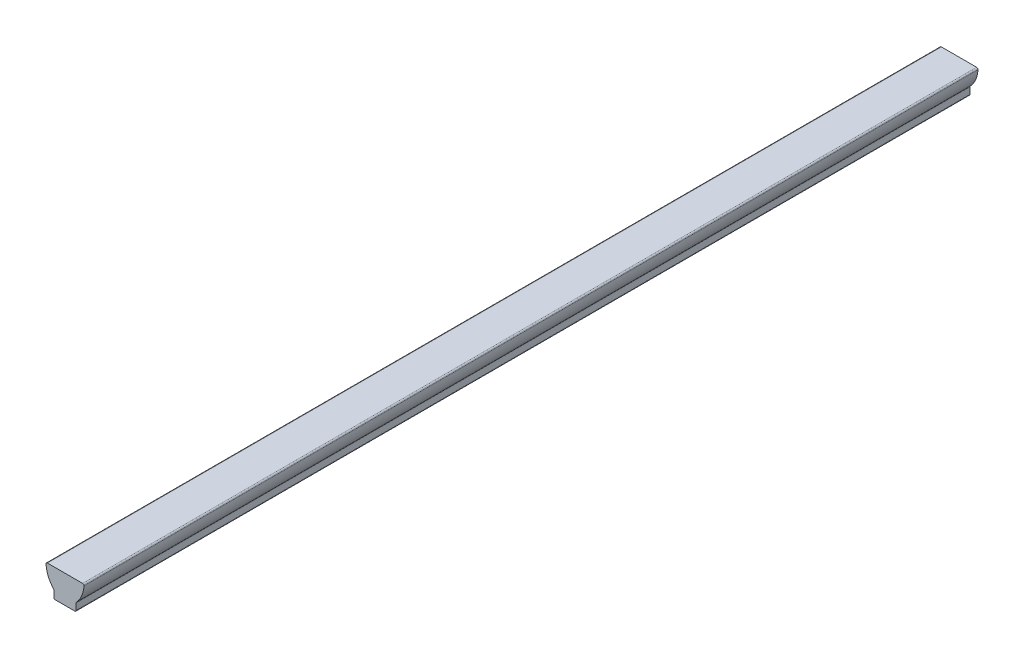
ISO-10303-21;
HEADER;
FILE_DESCRIPTION(('STEP AP214'),'2;1');
FILE_NAME('part.step','',(''),(''),'','','');
FILE_SCHEMA(('AUTOMOTIVE_DESIGN { 1 0 10303 214 1 1 1 1 }'));
ENDSEC;
DATA;
#1=APPLICATION_CONTEXT('core data for automotive mechanical design processes');
#2=APPLICATION_PROTOCOL_DEFINITION('international standard','automotive_design',2000,#1);
#3=PRODUCT_CONTEXT('',#1,'mechanical');
#4=PRODUCT('Part','Part','',(#3));
#5=PRODUCT_RELATED_PRODUCT_CATEGORY('part','',(#4));
#6=PRODUCT_DEFINITION_FORMATION('','',#4);
#7=PRODUCT_DEFINITION_CONTEXT('part definition',#1,'design');
#8=PRODUCT_DEFINITION('design','',#6,#7);
#9=PRODUCT_DEFINITION_SHAPE('','',#8);
#10=(LENGTH_UNIT() NAMED_UNIT(*) SI_UNIT(.MILLI.,.METRE.));
#11=(NAMED_UNIT(*) PLANE_ANGLE_UNIT() SI_UNIT($,.RADIAN.));
#12=(NAMED_UNIT(*) SI_UNIT($,.STERADIAN.) SOLID_ANGLE_UNIT());
#13=UNCERTAINTY_MEASURE_WITH_UNIT(LENGTH_MEASURE(1.E-05),#10,'distance_accuracy_value','');
#14=(GEOMETRIC_REPRESENTATION_CONTEXT(3) GLOBAL_UNCERTAINTY_ASSIGNED_CONTEXT((#13)) GLOBAL_UNIT_ASSIGNED_CONTEXT((#10,
#11,#12)) REPRESENTATION_CONTEXT('',''));
#15=CARTESIAN_POINT('',(0.,0.,0.));
#16=DIRECTION('',(0.,0.,1.));
#17=DIRECTION('',(1.,0.,0.));
#18=AXIS2_PLACEMENT_3D('',#15,#16,#17);
#19=CARTESIAN_POINT('',(-10.0126712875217,15.0876,508.));
#20=DIRECTION('',(0.,0.,-1.));
#21=DIRECTION('',(-1.,0.,0.));
#22=AXIS2_PLACEMENT_3D('',#19,#20,#21);
#23=CYLINDRICAL_SURFACE('',#22,0.7874);
#24=CARTESIAN_POINT('',(-10.0126712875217,15.0876,0.));
#25=DIRECTION('',(0.,0.,1.));
#26=DIRECTION('',(-1.,0.,0.));
#27=AXIS2_PLACEMENT_3D('',#24,#25,#26);
#28=CIRCLE('',#27,0.7874);
#29=CARTESIAN_POINT('',(-10.0126712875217,15.875,0.));
#30=VERTEX_POINT('',#29);
#31=CARTESIAN_POINT('',(-10.7990223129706,15.0469696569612,0.));
#32=VERTEX_POINT('',#31);
#33=EDGE_CURVE('E106',#30,#32,#28,.T.);
#34=ORIENTED_EDGE('',*,*,#33,.T.);
#35=DIRECTION('',(0.,0.,-1.));
#36=VECTOR('',#35,1.);
#37=CARTESIAN_POINT('',(-10.7990223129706,15.0469696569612,508.));
#38=LINE('',#37,#36);
#39=CARTESIAN_POINT('',(-10.7990223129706,15.0469696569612,508.));
#40=VERTEX_POINT('',#39);
#41=EDGE_CURVE('E9',#40,#32,#38,.T.);
#42=ORIENTED_EDGE('',*,*,#41,.F.);
#43=CARTESIAN_POINT('',(-10.0126712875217,15.0876,508.));
#44=DIRECTION('',(0.,0.,1.));
#45=DIRECTION('',(-1.,0.,0.));
#46=AXIS2_PLACEMENT_3D('',#43,#44,#45);
#47=CIRCLE('',#46,0.7874);
#48=CARTESIAN_POINT('',(-10.0126712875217,15.875,508.));
#49=VERTEX_POINT('',#48);
#50=EDGE_CURVE('E141',#49,#40,#47,.T.);
#51=ORIENTED_EDGE('',*,*,#50,.F.);
#52=DIRECTION('',(0.,0.,-1.));
#53=VECTOR('',#52,1.);
#54=CARTESIAN_POINT('',(-10.0126712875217,15.875,508.));
#55=LINE('',#54,#53);
#56=EDGE_CURVE('E119',#49,#30,#55,.T.);
#57=ORIENTED_EDGE('',*,*,#56,.T.);
#58=EDGE_LOOP('',(#34,#42,#51,#57));
#59=FACE_BOUND('',#58,.T.);
#60=ADVANCED_FACE('F14',(#59),#23,.T.);
#61=CARTESIAN_POINT('',(5.22650099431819,15.875,508.));
#62=DIRECTION('',(0.,0.,-1.));
#63=DIRECTION('',(-1.,0.,0.));
#64=AXIS2_PLACEMENT_3D('',#61,#62,#63);
#65=CYLINDRICAL_SURFACE('',#64,16.0469009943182);
#66=CARTESIAN_POINT('',(5.22650099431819,15.875,0.));
#67=DIRECTION('',(0.,0.,1.));
#68=DIRECTION('',(1.,0.,0.));
#69=AXIS2_PLACEMENT_3D('',#66,#67,#68);
#70=CIRCLE('',#69,16.0469009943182);
#71=CARTESIAN_POINT('',(-6.55909647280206,4.98451223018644,0.));
#72=VERTEX_POINT('',#71);
#73=EDGE_CURVE('E102',#32,#72,#70,.T.);
#74=ORIENTED_EDGE('',*,*,#73,.T.);
#75=DIRECTION('',(0.,0.,-1.));
#76=VECTOR('',#75,1.);
#77=CARTESIAN_POINT('',(-6.55909647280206,4.98451223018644,508.));
#78=LINE('',#77,#76);
#79=CARTESIAN_POINT('',(-6.55909647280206,4.98451223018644,508.));
#80=VERTEX_POINT('',#79);
#81=EDGE_CURVE('E21',#80,#72,#78,.T.);
#82=ORIENTED_EDGE('',*,*,#81,.F.);
#83=CARTESIAN_POINT('',(5.22650099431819,15.875,508.));
#84=DIRECTION('',(0.,0.,1.));
#85=DIRECTION('',(1.,0.,0.));
#86=AXIS2_PLACEMENT_3D('',#83,#84,#85);
#87=CIRCLE('',#86,16.0469009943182);
#88=EDGE_CURVE('E115',#40,#80,#87,.T.);
#89=ORIENTED_EDGE('',*,*,#88,.F.);
#90=ORIENTED_EDGE('',*,*,#41,.T.);
#91=EDGE_LOOP('',(#74,#82,#89,#90));
#92=FACE_BOUND('',#91,.T.);
#93=ADVANCED_FACE('F114',(#92),#65,.T.);
#94=CARTESIAN_POINT('',(-7.1374,4.45013054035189,508.));
#95=DIRECTION('',(0.,0.,-1.));
#96=DIRECTION('',(-1.,0.,0.));
#97=AXIS2_PLACEMENT_3D('',#94,#95,#96);
#98=CYLINDRICAL_SURFACE('',#97,0.7874);
#99=CARTESIAN_POINT('',(-7.1374,4.45013054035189,0.));
#100=DIRECTION('',(0.,0.,-1.));
#101=DIRECTION('',(-1.,0.,0.));
#102=AXIS2_PLACEMENT_3D('',#99,#100,#101);
#103=CIRCLE('',#102,0.7874);
#104=CARTESIAN_POINT('',(-6.35,4.45013054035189,0.));
#105=VERTEX_POINT('',#104);
#106=EDGE_CURVE('E108',#72,#105,#103,.T.);
#107=ORIENTED_EDGE('',*,*,#106,.T.);
#108=DIRECTION('',(0.,0.,-1.));
#109=VECTOR('',#108,1.);
#110=CARTESIAN_POINT('',(-6.35,4.45013054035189,508.));
#111=LINE('',#110,#109);
#112=CARTESIAN_POINT('',(-6.35,4.45013054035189,508.));
#113=VERTEX_POINT('',#112);
#114=EDGE_CURVE('E187',#113,#105,#111,.T.);
#115=ORIENTED_EDGE('',*,*,#114,.F.);
#116=CARTESIAN_POINT('',(-7.1374,4.45013054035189,508.));
#117=DIRECTION('',(0.,0.,-1.));
#118=DIRECTION('',(-1.,0.,0.));
#119=AXIS2_PLACEMENT_3D('',#116,#117,#118);
#120=CIRCLE('',#119,0.7874);
#121=EDGE_CURVE('E144',#80,#113,#120,.T.);
#122=ORIENTED_EDGE('',*,*,#121,.F.);
#123=ORIENTED_EDGE('',*,*,#81,.T.);
#124=EDGE_LOOP('',(#107,#115,#122,#123));
#125=FACE_BOUND('',#124,.T.);
#126=ADVANCED_FACE('F191',(#125),#98,.F.);
#127=CARTESIAN_POINT('',(-6.35,0.7874,508.));
#128=DIRECTION('',(1.,0.,0.));
#129=DIRECTION('',(0.,0.,-1.));
#130=AXIS2_PLACEMENT_3D('',#127,#128,#129);
#131=PLANE('',#130);
#132=DIRECTION('',(0.,-1.,0.));
#133=VECTOR('',#132,1.);
#134=CARTESIAN_POINT('',(-6.35,0.7874,0.));
#135=LINE('',#134,#133);
#136=CARTESIAN_POINT('',(-6.35,0.7874,0.));
#137=VERTEX_POINT('',#136);
#138=EDGE_CURVE('E123',#105,#137,#135,.T.);
#139=ORIENTED_EDGE('',*,*,#138,.T.);
#140=DIRECTION('',(0.,0.,-1.));
#141=VECTOR('',#140,1.);
#142=CARTESIAN_POINT('',(-6.35,0.7874,508.));
#143=LINE('',#142,#141);
#144=CARTESIAN_POINT('',(-6.35,0.7874,508.));
#145=VERTEX_POINT('',#144);
#146=EDGE_CURVE('E184',#145,#137,#143,.T.);
#147=ORIENTED_EDGE('',*,*,#146,.F.);
#148=DIRECTION('',(0.,-1.,0.));
#149=VECTOR('',#148,1.);
#150=CARTESIAN_POINT('',(-6.35,0.7874,508.));
#151=LINE('',#150,#149);
#152=EDGE_CURVE('E146',#113,#145,#151,.T.);
#153=ORIENTED_EDGE('',*,*,#152,.F.);
#154=ORIENTED_EDGE('',*,*,#114,.T.);
#155=EDGE_LOOP('',(#139,#147,#153,#154));
#156=FACE_BOUND('',#155,.T.);
#157=ADVANCED_FACE('F199',(#156),#131,.F.);
#158=CARTESIAN_POINT('',(-5.5626,0.7874,508.));
#159=DIRECTION('',(0.,0.,-1.));
#160=DIRECTION('',(-1.,0.,0.));
#161=AXIS2_PLACEMENT_3D('',#158,#159,#160);
#162=CYLINDRICAL_SURFACE('',#161,0.7874);
#163=CARTESIAN_POINT('',(-5.5626,0.7874,0.));
#164=DIRECTION('',(0.,0.,1.));
#165=DIRECTION('',(1.,0.,0.));
#166=AXIS2_PLACEMENT_3D('',#163,#164,#165);
#167=CIRCLE('',#166,0.7874);
#168=CARTESIAN_POINT('',(-5.5626,0.,0.));
#169=VERTEX_POINT('',#168);
#170=EDGE_CURVE('E125',#137,#169,#167,.T.);
#171=ORIENTED_EDGE('',*,*,#170,.T.);
#172=DIRECTION('',(0.,0.,-1.));
#173=VECTOR('',#172,1.);
#174=CARTESIAN_POINT('',(-5.5626,0.,508.));
#175=LINE('',#174,#173);
#176=CARTESIAN_POINT('',(-5.5626,0.,508.));
#177=VERTEX_POINT('',#176);
#178=EDGE_CURVE('E181',#177,#169,#175,.T.);
#179=ORIENTED_EDGE('',*,*,#178,.F.);
#180=CARTESIAN_POINT('',(-5.5626,0.7874,508.));
#181=DIRECTION('',(0.,0.,1.));
#182=DIRECTION('',(1.,0.,0.));
#183=AXIS2_PLACEMENT_3D('',#180,#181,#182);
#184=CIRCLE('',#183,0.7874);
#185=EDGE_CURVE('E148',#145,#177,#184,.T.);
#186=ORIENTED_EDGE('',*,*,#185,.F.);
#187=ORIENTED_EDGE('',*,*,#146,.T.);
#188=EDGE_LOOP('',(#171,#179,#186,#187));
#189=FACE_BOUND('',#188,.T.);
#190=ADVANCED_FACE('F202',(#189),#162,.T.);
#191=CARTESIAN_POINT('',(-5.5626,0.,508.));
#192=DIRECTION('',(0.,1.,0.));
#193=DIRECTION('',(0.,0.,1.));
#194=AXIS2_PLACEMENT_3D('',#191,#192,#193);
#195=PLANE('',#194);
#196=DIRECTION('',(1.,0.,0.));
#197=VECTOR('',#196,1.);
#198=CARTESIAN_POINT('',(-5.5626,0.,0.));
#199=LINE('',#198,#197);
#200=CARTESIAN_POINT('',(5.5626,0.,0.));
#201=VERTEX_POINT('',#200);
#202=EDGE_CURVE('E127',#169,#201,#199,.T.);
#203=ORIENTED_EDGE('',*,*,#202,.T.);
#204=DIRECTION('',(0.,0.,-1.));
#205=VECTOR('',#204,1.);
#206=CARTESIAN_POINT('',(5.5626,0.,508.));
#207=LINE('',#206,#205);
#208=CARTESIAN_POINT('',(5.5626,0.,508.));
#209=VERTEX_POINT('',#208);
#210=EDGE_CURVE('E178',#209,#201,#207,.T.);
#211=ORIENTED_EDGE('',*,*,#210,.F.);
#212=DIRECTION('',(1.,0.,0.));
#213=VECTOR('',#212,1.);
#214=CARTESIAN_POINT('',(-5.5626,0.,508.));
#215=LINE('',#214,#213);
#216=EDGE_CURVE('E150',#177,#209,#215,.T.);
#217=ORIENTED_EDGE('',*,*,#216,.F.);
#218=ORIENTED_EDGE('',*,*,#178,.T.);
#219=EDGE_LOOP('',(#203,#211,#217,#218));
#220=FACE_BOUND('',#219,.T.);
#221=ADVANCED_FACE('F207',(#220),#195,.F.);
#222=CARTESIAN_POINT('',(5.5626,0.7874,508.));
#223=DIRECTION('',(0.,0.,-1.));
#224=DIRECTION('',(-1.,0.,0.));
#225=AXIS2_PLACEMENT_3D('',#222,#223,#224);
#226=CYLINDRICAL_SURFACE('',#225,0.7874);
#227=CARTESIAN_POINT('',(5.5626,0.7874,0.));
#228=DIRECTION('',(0.,0.,1.));
#229=DIRECTION('',(1.,0.,0.));
#230=AXIS2_PLACEMENT_3D('',#227,#228,#229);
#231=CIRCLE('',#230,0.7874);
#232=CARTESIAN_POINT('',(6.35,0.7874,0.));
#233=VERTEX_POINT('',#232);
#234=EDGE_CURVE('E129',#201,#233,#231,.T.);
#235=ORIENTED_EDGE('',*,*,#234,.T.);
#236=DIRECTION('',(0.,0.,-1.));
#237=VECTOR('',#236,1.);
#238=CARTESIAN_POINT('',(6.35,0.7874,508.));
#239=LINE('',#238,#237);
#240=CARTESIAN_POINT('',(6.35,0.7874,508.));
#241=VERTEX_POINT('',#240);
#242=EDGE_CURVE('E175',#241,#233,#239,.T.);
#243=ORIENTED_EDGE('',*,*,#242,.F.);
#244=CARTESIAN_POINT('',(5.5626,0.7874,508.));
#245=DIRECTION('',(0.,0.,1.));
#246=DIRECTION('',(1.,0.,0.));
#247=AXIS2_PLACEMENT_3D('',#244,#245,#246);
#248=CIRCLE('',#247,0.7874);
#249=EDGE_CURVE('E152',#209,#241,#248,.T.);
#250=ORIENTED_EDGE('',*,*,#249,.F.);
#251=ORIENTED_EDGE('',*,*,#210,.T.);
#252=EDGE_LOOP('',(#235,#243,#250,#251));
#253=FACE_BOUND('',#252,.T.);
#254=ADVANCED_FACE('F213',(#253),#226,.T.);
#255=CARTESIAN_POINT('',(6.35,0.7874,508.));
#256=DIRECTION('',(-1.,0.,0.));
#257=DIRECTION('',(0.,0.,1.));
#258=AXIS2_PLACEMENT_3D('',#255,#256,#257);
#259=PLANE('',#258);
#260=DIRECTION('',(0.,1.,0.));
#261=VECTOR('',#260,1.);
#262=CARTESIAN_POINT('',(6.35,0.7874,0.));
#263=LINE('',#262,#261);
#264=CARTESIAN_POINT('',(6.35,4.45013054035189,0.));
#265=VERTEX_POINT('',#264);
#266=EDGE_CURVE('E131',#233,#265,#263,.T.);
#267=ORIENTED_EDGE('',*,*,#266,.T.);
#268=DIRECTION('',(0.,0.,-1.));
#269=VECTOR('',#268,1.);
#270=CARTESIAN_POINT('',(6.35,4.45013054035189,508.));
#271=LINE('',#270,#269);
#272=CARTESIAN_POINT('',(6.35,4.45013054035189,508.));
#273=VERTEX_POINT('',#272);
#274=EDGE_CURVE('E172',#273,#265,#271,.T.);
#275=ORIENTED_EDGE('',*,*,#274,.F.);
#276=DIRECTION('',(0.,1.,0.));
#277=VECTOR('',#276,1.);
#278=CARTESIAN_POINT('',(6.35,0.7874,508.));
#279=LINE('',#278,#277);
#280=EDGE_CURVE('E154',#241,#273,#279,.T.);
#281=ORIENTED_EDGE('',*,*,#280,.F.);
#282=ORIENTED_EDGE('',*,*,#242,.T.);
#283=EDGE_LOOP('',(#267,#275,#281,#282));
#284=FACE_BOUND('',#283,.T.);
#285=ADVANCED_FACE('F217',(#284),#259,.F.);
#286=CARTESIAN_POINT('',(7.1374,4.45013054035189,508.));
#287=DIRECTION('',(0.,0.,-1.));
#288=DIRECTION('',(-1.,0.,0.));
#289=AXIS2_PLACEMENT_3D('',#286,#287,#288);
#290=CYLINDRICAL_SURFACE('',#289,0.7874);
#291=CARTESIAN_POINT('',(7.1374,4.45013054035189,0.));
#292=DIRECTION('',(0.,0.,-1.));
#293=DIRECTION('',(-1.,0.,0.));
#294=AXIS2_PLACEMENT_3D('',#291,#292,#293);
#295=CIRCLE('',#294,0.7874);
#296=CARTESIAN_POINT('',(6.55909647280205,4.98451223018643,0.));
#297=VERTEX_POINT('',#296);
#298=EDGE_CURVE('E133',#265,#297,#295,.T.);
#299=ORIENTED_EDGE('',*,*,#298,.T.);
#300=DIRECTION('',(0.,0.,-1.));
#301=VECTOR('',#300,1.);
#302=CARTESIAN_POINT('',(6.55909647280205,4.98451223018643,508.));
#303=LINE('',#302,#301);
#304=CARTESIAN_POINT('',(6.55909647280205,4.98451223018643,508.));
#305=VERTEX_POINT('',#304);
#306=EDGE_CURVE('E169',#305,#297,#303,.T.);
#307=ORIENTED_EDGE('',*,*,#306,.F.);
#308=CARTESIAN_POINT('',(7.1374,4.45013054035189,508.));
#309=DIRECTION('',(0.,0.,-1.));
#310=DIRECTION('',(-1.,0.,0.));
#311=AXIS2_PLACEMENT_3D('',#308,#309,#310);
#312=CIRCLE('',#311,0.7874);
#313=EDGE_CURVE('E156',#273,#305,#312,.T.);
#314=ORIENTED_EDGE('',*,*,#313,.F.);
#315=ORIENTED_EDGE('',*,*,#274,.T.);
#316=EDGE_LOOP('',(#299,#307,#314,#315));
#317=FACE_BOUND('',#316,.T.);
#318=ADVANCED_FACE('F222',(#317),#290,.F.);
#319=CARTESIAN_POINT('',(-5.22650099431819,15.875,508.));
#320=DIRECTION('',(0.,0.,-1.));
#321=DIRECTION('',(-1.,0.,0.));
#322=AXIS2_PLACEMENT_3D('',#319,#320,#321);
#323=CYLINDRICAL_SURFACE('',#322,16.0469009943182);
#324=CARTESIAN_POINT('',(-5.22650099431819,15.875,0.));
#325=DIRECTION('',(0.,0.,1.));
#326=DIRECTION('',(-1.,0.,0.));
#327=AXIS2_PLACEMENT_3D('',#324,#325,#326);
#328=CIRCLE('',#327,16.0469009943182);
#329=CARTESIAN_POINT('',(10.7990223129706,15.0469696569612,0.));
#330=VERTEX_POINT('',#329);
#331=EDGE_CURVE('E135',#297,#330,#328,.T.);
#332=ORIENTED_EDGE('',*,*,#331,.T.);
#333=DIRECTION('',(0.,0.,-1.));
#334=VECTOR('',#333,1.);
#335=CARTESIAN_POINT('',(10.7990223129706,15.0469696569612,508.));
#336=LINE('',#335,#334);
#337=CARTESIAN_POINT('',(10.7990223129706,15.0469696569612,508.));
#338=VERTEX_POINT('',#337);
#339=EDGE_CURVE('E166',#338,#330,#336,.T.);
#340=ORIENTED_EDGE('',*,*,#339,.F.);
#341=CARTESIAN_POINT('',(-5.22650099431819,15.875,508.));
#342=DIRECTION('',(0.,0.,1.));
#343=DIRECTION('',(-1.,0.,0.));
#344=AXIS2_PLACEMENT_3D('',#341,#342,#343);
#345=CIRCLE('',#344,16.0469009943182);
#346=EDGE_CURVE('E158',#305,#338,#345,.T.);
#347=ORIENTED_EDGE('',*,*,#346,.F.);
#348=ORIENTED_EDGE('',*,*,#306,.T.);
#349=EDGE_LOOP('',(#332,#340,#347,#348));
#350=FACE_BOUND('',#349,.T.);
#351=ADVANCED_FACE('F226',(#350),#323,.T.);
#352=CARTESIAN_POINT('',(10.0126712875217,15.0876,508.));
#353=DIRECTION('',(0.,0.,-1.));
#354=DIRECTION('',(-1.,0.,0.));
#355=AXIS2_PLACEMENT_3D('',#352,#353,#354);
#356=CYLINDRICAL_SURFACE('',#355,0.7874);
#357=CARTESIAN_POINT('',(10.0126712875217,15.0876,0.));
#358=DIRECTION('',(0.,0.,1.));
#359=DIRECTION('',(-1.,0.,0.));
#360=AXIS2_PLACEMENT_3D('',#357,#358,#359);
#361=CIRCLE('',#360,0.7874);
#362=CARTESIAN_POINT('',(10.0126712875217,15.875,0.));
#363=VERTEX_POINT('',#362);
#364=EDGE_CURVE('E137',#330,#363,#361,.T.);
#365=ORIENTED_EDGE('',*,*,#364,.T.);
#366=DIRECTION('',(0.,0.,-1.));
#367=VECTOR('',#366,1.);
#368=CARTESIAN_POINT('',(10.0126712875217,15.875,508.));
#369=LINE('',#368,#367);
#370=CARTESIAN_POINT('',(10.0126712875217,15.875,508.));
#371=VERTEX_POINT('',#370);
#372=EDGE_CURVE('E163',#371,#363,#369,.T.);
#373=ORIENTED_EDGE('',*,*,#372,.F.);
#374=CARTESIAN_POINT('',(10.0126712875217,15.0876,508.));
#375=DIRECTION('',(0.,0.,1.));
#376=DIRECTION('',(-1.,0.,0.));
#377=AXIS2_PLACEMENT_3D('',#374,#375,#376);
#378=CIRCLE('',#377,0.7874);
#379=EDGE_CURVE('E33',#338,#371,#378,.T.);
#380=ORIENTED_EDGE('',*,*,#379,.F.);
#381=ORIENTED_EDGE('',*,*,#339,.T.);
#382=EDGE_LOOP('',(#365,#373,#380,#381));
#383=FACE_BOUND('',#382,.T.);
#384=ADVANCED_FACE('F230',(#383),#356,.T.);
#385=CARTESIAN_POINT('',(-10.0126712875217,15.875,508.));
#386=DIRECTION('',(0.,-1.,0.));
#387=DIRECTION('',(0.,0.,-1.));
#388=AXIS2_PLACEMENT_3D('',#385,#386,#387);
#389=PLANE('',#388);
#390=DIRECTION('',(-1.,0.,0.));
#391=VECTOR('',#390,1.);
#392=CARTESIAN_POINT('',(-10.0126712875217,15.875,0.));
#393=LINE('',#392,#391);
#394=EDGE_CURVE('E139',#363,#30,#393,.T.);
#395=ORIENTED_EDGE('',*,*,#394,.T.);
#396=ORIENTED_EDGE('',*,*,#56,.F.);
#397=DIRECTION('',(-1.,0.,0.));
#398=VECTOR('',#397,1.);
#399=CARTESIAN_POINT('',(-10.0126712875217,15.875,508.));
#400=LINE('',#399,#398);
#401=EDGE_CURVE('E28',#371,#49,#400,.T.);
#402=ORIENTED_EDGE('',*,*,#401,.F.);
#403=ORIENTED_EDGE('',*,*,#372,.T.);
#404=EDGE_LOOP('',(#395,#396,#402,#403));
#405=FACE_BOUND('',#404,.T.);
#406=ADVANCED_FACE('F232',(#405),#389,.F.);
#407=CARTESIAN_POINT('',(-10.0126712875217,15.0876,508.));
#408=DIRECTION('',(0.,0.,-1.));
#409=DIRECTION('',(-1.,0.,0.));
#410=AXIS2_PLACEMENT_3D('',#407,#408,#409);
#411=PLANE('',#410);
#412=ORIENTED_EDGE('',*,*,#50,.T.);
#413=ORIENTED_EDGE('',*,*,#88,.T.);
#414=ORIENTED_EDGE('',*,*,#121,.T.);
#415=ORIENTED_EDGE('',*,*,#152,.T.);
#416=ORIENTED_EDGE('',*,*,#185,.T.);
#417=ORIENTED_EDGE('',*,*,#216,.T.);
#418=ORIENTED_EDGE('',*,*,#249,.T.);
#419=ORIENTED_EDGE('',*,*,#280,.T.);
#420=ORIENTED_EDGE('',*,*,#313,.T.);
#421=ORIENTED_EDGE('',*,*,#346,.T.);
#422=ORIENTED_EDGE('',*,*,#379,.T.);
#423=ORIENTED_EDGE('',*,*,#401,.T.);
#424=EDGE_LOOP('',(#412,#413,#414,#415,#416,#417,#418,#419,#420,#421,#422,#423));
#425=FACE_BOUND('',#424,.T.);
#426=ADVANCED_FACE('F194',(#425),#411,.F.);
#427=CARTESIAN_POINT('',(-10.0126712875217,15.0876,0.));
#428=DIRECTION('',(0.,0.,-1.));
#429=DIRECTION('',(-1.,0.,0.));
#430=AXIS2_PLACEMENT_3D('',#427,#428,#429);
#431=PLANE('',#430);
#432=ORIENTED_EDGE('',*,*,#33,.F.);
#433=ORIENTED_EDGE('',*,*,#394,.F.);
#434=ORIENTED_EDGE('',*,*,#364,.F.);
#435=ORIENTED_EDGE('',*,*,#331,.F.);
#436=ORIENTED_EDGE('',*,*,#298,.F.);
#437=ORIENTED_EDGE('',*,*,#266,.F.);
#438=ORIENTED_EDGE('',*,*,#234,.F.);
#439=ORIENTED_EDGE('',*,*,#202,.F.);
#440=ORIENTED_EDGE('',*,*,#170,.F.);
#441=ORIENTED_EDGE('',*,*,#138,.F.);
#442=ORIENTED_EDGE('',*,*,#106,.F.);
#443=ORIENTED_EDGE('',*,*,#73,.F.);
#444=EDGE_LOOP('',(#432,#433,#434,#435,#436,#437,#438,#439,#440,#441,#442,#443));
#445=FACE_BOUND('',#444,.T.);
#446=ADVANCED_FACE('F103',(#445),#431,.T.);
#447=CLOSED_SHELL('',(#60,#93,#126,#157,#190,#221,#254,#285,#318,#351,#384,#406,#426,#446));
#448=MANIFOLD_SOLID_BREP('B1',#447);
#449=ADVANCED_BREP_SHAPE_REPRESENTATION('',(#18,#448),#14);
#450=SHAPE_DEFINITION_REPRESENTATION(#9,#449);
ENDSEC;
END-ISO-10303-21;
